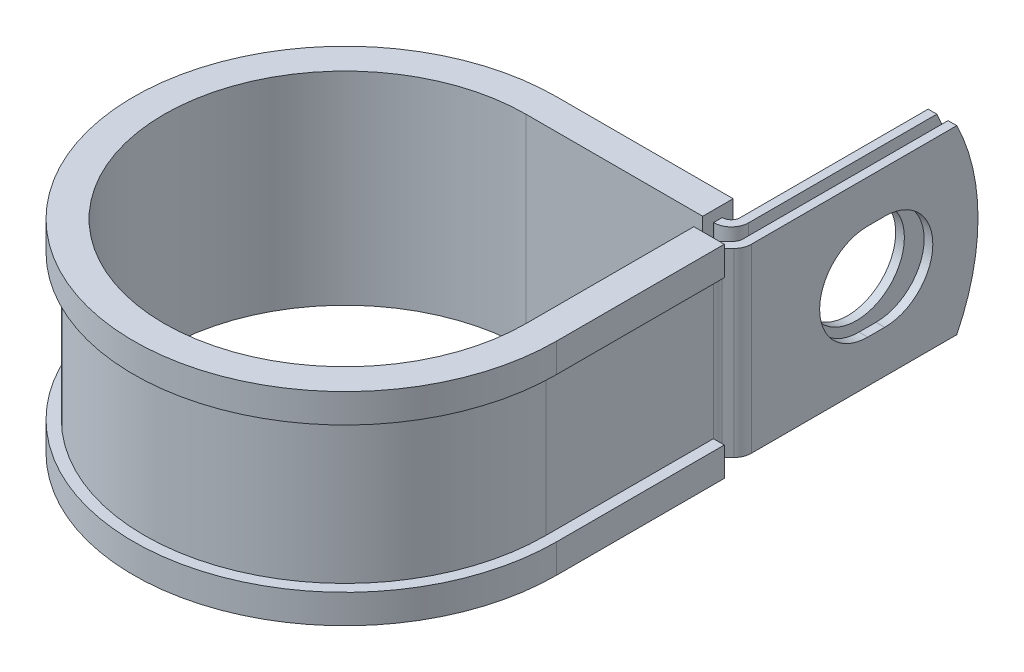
from build123d import *

# Parameters (mm, degrees)
EXTRUDE_THIN1_DEPTH = 12.7
SKETCH2_R           = 6.7437
CUT_EXTRUDE1_DEPTH  = 1.2192
CUT_EXTRUDE2_DEPTH  = 1.2192
CUT_EXTRUDE3_DEPTH  = 81.897179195


with BuildPart() as part:
    # Sketch1 → Extrude-Thin1 (new, symmetric)
    with BuildSketch(Plane(origin=(0, 0, 0), x_dir=(1, 0, 0), z_dir=(0, 1, 0))):
        with BuildLine():
            Line((28.8214698, 58.7248), (28.8214698, 26.924))
            ThreePointArc((28.8214698, 26.924), (28.728663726, 26.457432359), (28.464374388, 26.061895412))
            Line((28.464374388, 26.061895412), (27.638190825, 25.235711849))
            ThreePointArc((27.638190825, 25.235711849), (27.109612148, 24.444637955), (26.924, 23.511502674))
            Line((26.924, 23.511502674), (26.924, 0))
            ThreePointArc((26.924, 0), (-19.038142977, -19.038142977), (0, 26.924))
            Line((0, 26.924), (24.8082698, 26.924))
            ThreePointArc((24.8082698, 26.924), (26.532478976, 27.638190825), (27.2466698, 29.3624))
            Line((27.2466698, 29.3624), (27.2466698, 58.7248))
            Line((27.2466698, 58.7248), (26.0274698, 58.7248))
            Line((26.0274698, 58.7248), (26.0274698, 29.3624))
            ThreePointArc((26.0274698, 29.3624), (25.670374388, 28.500295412), (24.8082698, 28.1432))
            Line((24.8082698, 28.1432), (0, 28.1432))
            ThreePointArc((0, 28.1432), (-19.900247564, -19.900247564), (28.1432, 0))
            Line((28.1432, 0), (28.1432, 23.511502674))
            ThreePointArc((28.1432, 23.511502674), (28.236006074, 23.978070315), (28.500295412, 24.373607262))
            Line((28.500295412, 24.373607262), (29.326478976, 25.199790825))
            ThreePointArc((29.326478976, 25.199790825), (29.855057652, 25.990864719), (30.0406698, 26.924))
            Line((30.0406698, 26.924), (30.0406698, 58.7248))
            Line((30.0406698, 58.7248), (28.8214698, 58.7248))
        make_face()
    extrude(amount=EXTRUDE_THIN1_DEPTH, both=True)

    # Sketch2 → Cut-Extrude1 (cut)
    with BuildSketch(Plane.ZY.offset(-26.0274698)):
        with Locations((-44.45, 0)):
            Circle(SKETCH2_R)
    extrude(amount=-CUT_EXTRUDE1_DEPTH, mode=Mode.SUBTRACT)

    # Sketch3 → Cut-Extrude2 (cut)
    with BuildSketch(Plane(origin=(30.0406698, 0, 0), x_dir=(0, 0, -1), z_dir=(1, 0, 0))):
        with BuildLine():
            Line((43.2562, 6.7437), (45.6438, 6.7437))
            ThreePointArc((45.6438, 6.7437), (52.3875, 0), (45.6438, -6.7437))
            Line((45.6438, -6.7437), (43.2562, -6.7437))
            ThreePointArc((43.2562, -6.7437), (36.5125, 0), (43.2562, 6.7437))
        make_face()
    extrude(amount=-CUT_EXTRUDE2_DEPTH, mode=Mode.SUBTRACT)

    # Sketch4 → Cut-Extrude3 (cut, through all)
    with BuildSketch(Plane.ZY.offset(-26.0274698)):
        with BuildLine():
            Line((-55.747468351, 12.7), (-58.7248, 12.7))
            Line((-58.7248, 12.7), (-58.7248, 0))
            ThreePointArc((-58.7248, 0), (-57.970511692, 6.522164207), (-55.747468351, 12.7))
        make_face()
        with BuildLine():
            ThreePointArc((-55.747468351, -12.7), (-57.970511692, -6.522164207), (-58.7248, 0))
            Line((-58.7248, 0), (-58.7248, -12.7))
            Line((-58.7248, -12.7), (-55.747468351, -12.7))
        make_face()
    extrude(amount=-CUT_EXTRUDE3_DEPTH, mode=Mode.SUBTRACT)

    # Sweep1: sweep along a path in Sketch6
    with BuildLine(Plane(origin=(0, 12.7, 0), x_dir=(1, 0, 0), z_dir=(0, 1, 0))) as sweep1_path:
        Line((25.4, 23.511502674), (25.4, 0))
        ThreePointArc((25.4, 0), (-17.960512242, -17.960512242), (0, 25.4))
        Line((0, 25.4), (24.7574698, 25.4))
    # Sketch5 → Sweep1 (sweep)
    with BuildSketch(Plane(origin=(0, 0, -23.511502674), x_dir=(-1, 0, 0), z_dir=(0, 0, -1))):
        Polygon((-28.1432, 12.7), (-26.924, 12.7), (-26.924, -12.7), (-28.1432, -12.7), (-28.1432, -10.16), (-29.6672, -10.16), (-29.6672, -14.224), (-25.4, -14.224), (-25.4, 14.224), (-29.6672, 14.224), (-29.6672, 10.16), (-28.1432, 10.16), align=None)
    sweep(path=sweep1_path.line)


solid = part.part
